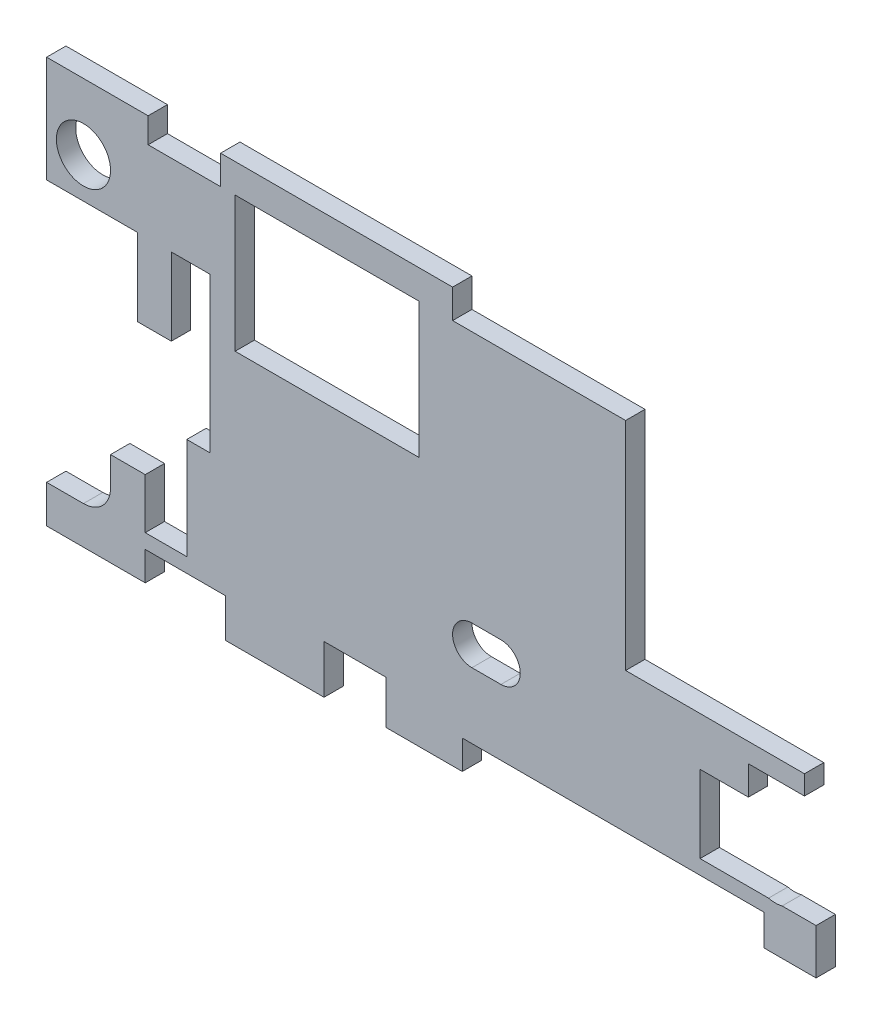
from build123d import *

# Parameters (mm, degrees)
SKETCH_1_W               = 85.1
SKETCH_1_H               = 55
SKETCH_1_R               = 2.8
EXTRUDE_1_DEPTH          = 2
SKETCH_2_W               = 19
SKETCH_2_H               = 14
CUT_EXTRUDE_2_DEPTH      = 51.702588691
CUT_EXTRUDE_3_DEPTH      = 49.215687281
CUT_EXTRUDE_3_DEPTH_BACK = 49.215687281
SKETCH_4_W               = 0.6
SKETCH_4_H               = 3.2
CUT_EXTRUDE_4_DEPTH      = 48.942700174


with BuildPart() as part:
    # Sketch 1 → Extrude 1 (new body)
    with BuildSketch(Plane.XY):
        Rectangle(SKETCH_1_W, SKETCH_1_H)
        with Locations((-38.74, 14.16)):
            Circle(SKETCH_1_R, mode=Mode.SUBTRACT)
        with Locations((32.84, -14.29)):
            Circle(SKETCH_1_R, mode=Mode.SUBTRACT)
        with Locations((-38.74, -14.29)):
            Circle(SKETCH_1_R, mode=Mode.SUBTRACT)
    extrude(amount=EXTRUDE_1_DEPTH)

    # Sketch 2 → Cut-Extrude 2 (cut, through all)
    with BuildSketch(Plane.XY.offset(2)):
        with BuildLine():
            Line((-42.55, 27.5), (-42.55, 21))
            Line((-42.55, 21), (-32.05, 21))
            Line((-32.05, 21), (-32.05, 18.4))
            Line((-32.05, 18.4), (-24.55, 18.4))
            Line((-24.55, 18.4), (-24.55, 21.4))
            Line((-24.55, 21.4), (-0.55, 21.4))
            Line((-0.55, 21.4), (-0.55, 18.4))
            Line((-0.55, 18.4), (17.35, 18.4))
            Line((17.35, 18.4), (17.35, -4))
            Line((17.35, -4), (35.85, -4))
            Line((35.85, -4), (35.85, -6))
            Line((35.85, -6), (30.05, -6))
            Line((30.05, -6), (30.05, -9))
            Line((30.05, -9), (25.05, -9))
            Line((25.05, -9), (25.05, -17))
            Line((25.05, -17), (32.135798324, -17))
            ThreePointArc((32.135798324, -17), (32.84, -11.49), (33.544201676, -17))
            Line((33.544201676, -17), (37.05, -17))
            Line((37.05, -17), (37.05, -21.7))
            Line((37.05, -21.7), (31.05, -21.7))
            Line((31.05, -21.7), (31.05, -18.5))
            Line((31.05, -18.5), (0.45, -18.5))
            Line((0.45, -18.5), (0.45, -21.5))
            Line((0.45, -21.5), (-7.45, -21.5))
            Line((-7.45, -21.5), (-7.45, -17))
            Line((-7.45, -17), (-13.85, -17))
            Line((-13.85, -17), (-13.85, -22))
            Line((-13.85, -22), (-24.05, -22))
            Line((-24.05, -22), (-24.05, -18))
            Line((-24.05, -18), (-32.35, -18))
            Line((-32.35, -18), (-32.35, -21))
            Line((-32.35, -21), (-42.55, -21))
            Line((-42.55, -21), (-42.55, -27.5))
            Line((-42.55, -27.5), (42.55, -27.5))
            Line((42.55, -27.5), (42.55, 27.5))
            Line((42.55, 27.5), (-42.55, 27.5))
        make_face()
        with BuildLine():
            Line((-33.15, 10), (-42.55, 10))
            Line((-42.55, 10), (-42.55, -17.09))
            Line((-42.55, -17.09), (-38.74, -17.09))
            ThreePointArc((-38.74, -17.09), (-40.719898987, -12.310101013), (-35.94, -14.29))
            Line((-35.94, -14.29), (-35.94, -11.3))
            Line((-35.94, -11.3), (-32.35, -11.3))
            Line((-32.35, -11.3), (-32.35, -16.5))
            Line((-32.35, -16.5), (-28.05, -16.5))
            Line((-28.05, -16.5), (-28.05, -6))
            Line((-28.05, -6), (-25.65, -6))
            Line((-25.65, -6), (-25.65, 10))
            Line((-25.65, 10), (-29.65, 10))
            Line((-29.65, 10), (-29.65, 2))
            Line((-29.65, 2), (-33.15, 2))
            Line((-33.15, 2), (-33.15, 10))
        make_face()
        with Locations((-13.55, 11.4)):
            Rectangle(SKETCH_2_W, SKETCH_2_H)
    extrude(amount=-CUT_EXTRUDE_2_DEPTH, mode=Mode.SUBTRACT)

    # Sketch 3 → Cut-Extrude 3 (cut, two sides: drawn at the far end of the back side and taken through both)
    with BuildSketch(Plane.XY.offset(5.5).offset(-CUT_EXTRUDE_3_DEPTH_BACK)):
        with BuildLine():
            Line((1.45, -7.7), (4.45, -7.7))
            ThreePointArc((4.45, -7.7), (6.45, -9.7), (4.45, -11.7))
            Line((4.45, -11.7), (1.45, -11.7))
            ThreePointArc((1.45, -11.7), (-0.55, -9.7), (1.45, -7.7))
        make_face()
    extrude(amount=CUT_EXTRUDE_3_DEPTH + CUT_EXTRUDE_3_DEPTH_BACK, mode=Mode.SUBTRACT)

    # Sketch 4 → Cut-Extrude 4 (cut, through all)
    with BuildSketch(Plane.XY.offset(2)):
        with Locations((31.35, -20.1)):
            Rectangle(SKETCH_4_W, SKETCH_4_H)
    extrude(amount=-CUT_EXTRUDE_4_DEPTH, mode=Mode.SUBTRACT)


solid = part.part
